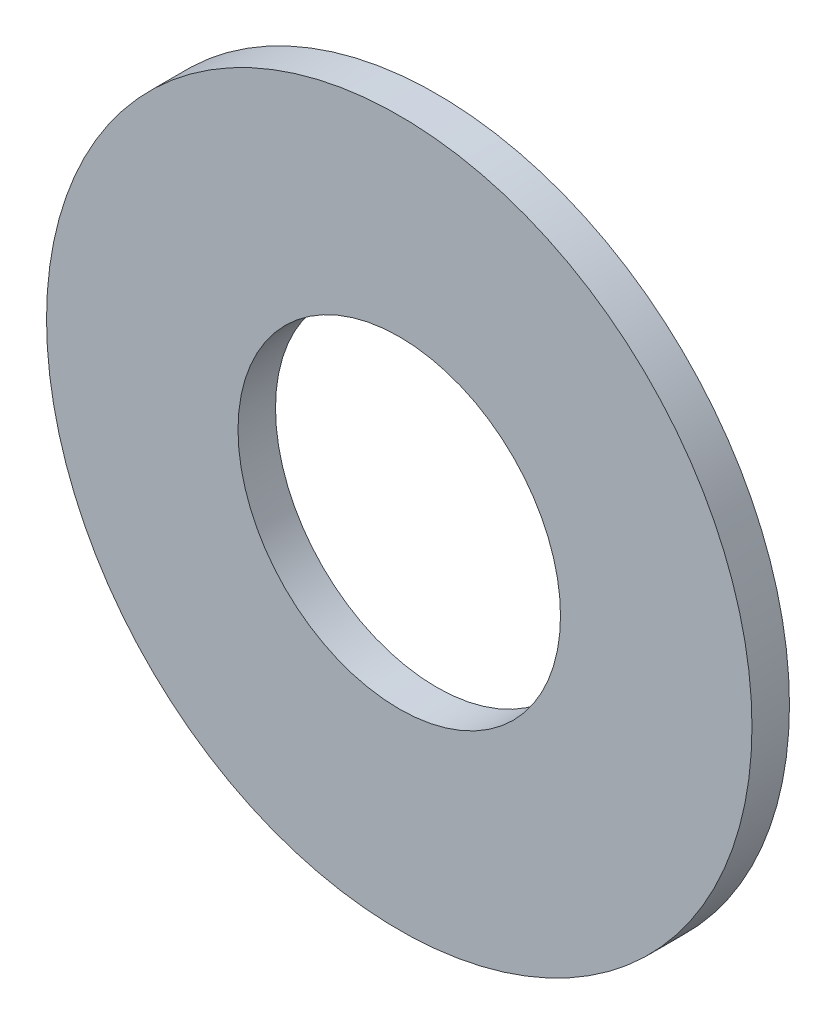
ISO-10303-21;
HEADER;
FILE_DESCRIPTION(('STEP AP214'),'2;1');
FILE_NAME('part.step','',(''),(''),'','','');
FILE_SCHEMA(('AUTOMOTIVE_DESIGN { 1 0 10303 214 1 1 1 1 }'));
ENDSEC;
DATA;
#1=APPLICATION_CONTEXT('core data for automotive mechanical design processes');
#2=APPLICATION_PROTOCOL_DEFINITION('international standard','automotive_design',2000,#1);
#3=PRODUCT_CONTEXT('',#1,'mechanical');
#4=PRODUCT('Part','Part','',(#3));
#5=PRODUCT_RELATED_PRODUCT_CATEGORY('part','',(#4));
#6=PRODUCT_DEFINITION_FORMATION('','',#4);
#7=PRODUCT_DEFINITION_CONTEXT('part definition',#1,'design');
#8=PRODUCT_DEFINITION('design','',#6,#7);
#9=PRODUCT_DEFINITION_SHAPE('','',#8);
#10=(LENGTH_UNIT() NAMED_UNIT(*) SI_UNIT(.MILLI.,.METRE.));
#11=(NAMED_UNIT(*) PLANE_ANGLE_UNIT() SI_UNIT($,.RADIAN.));
#12=(NAMED_UNIT(*) SI_UNIT($,.STERADIAN.) SOLID_ANGLE_UNIT());
#13=UNCERTAINTY_MEASURE_WITH_UNIT(LENGTH_MEASURE(1.E-05),#10,'distance_accuracy_value','');
#14=(GEOMETRIC_REPRESENTATION_CONTEXT(3) GLOBAL_UNCERTAINTY_ASSIGNED_CONTEXT((#13)) GLOBAL_UNIT_ASSIGNED_CONTEXT((#10,
#11,#12)) REPRESENTATION_CONTEXT('',''));
#15=CARTESIAN_POINT('',(0.,0.,0.));
#16=DIRECTION('',(0.,0.,1.));
#17=DIRECTION('',(1.,0.,0.));
#18=AXIS2_PLACEMENT_3D('',#15,#16,#17);
#19=CARTESIAN_POINT('',(0.,0.,-1.18109999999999));
#20=DIRECTION('',(0.,0.,1.));
#21=DIRECTION('',(1.00000000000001,0.,0.));
#22=AXIS2_PLACEMENT_3D('',#19,#20,#21);
#23=CYLINDRICAL_SURFACE('',#22,11.1125);
#24=CARTESIAN_POINT('',(0.,0.,-1.18109999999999));
#25=DIRECTION('',(0.,0.,1.));
#26=DIRECTION('',(1.00000000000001,0.,0.));
#27=AXIS2_PLACEMENT_3D('',#24,#25,#26);
#28=CIRCLE('',#27,11.1125);
#29=CARTESIAN_POINT('',(11.1125000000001,0.,-1.18109999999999));
#30=VERTEX_POINT('',#29);
#31=EDGE_CURVE('E10',#30,#30,#28,.T.);
#32=ORIENTED_EDGE('',*,*,#31,.T.);
#33=EDGE_LOOP('',(#32));
#34=FACE_BOUND('',#33,.T.);
#35=CARTESIAN_POINT('',(0.,0.,0.));
#36=DIRECTION('',(0.,0.,1.));
#37=DIRECTION('',(1.00000000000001,0.,0.));
#38=AXIS2_PLACEMENT_3D('',#35,#36,#37);
#39=CIRCLE('',#38,11.1125);
#40=CARTESIAN_POINT('',(11.1125000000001,0.,0.));
#41=VERTEX_POINT('',#40);
#42=EDGE_CURVE('E32',#41,#41,#39,.T.);
#43=ORIENTED_EDGE('',*,*,#42,.F.);
#44=EDGE_LOOP('',(#43));
#45=FACE_BOUND('',#44,.T.);
#46=ADVANCED_FACE('F26',(#34,#45),#23,.T.);
#47=CARTESIAN_POINT('',(0.,0.,-1.18109999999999));
#48=DIRECTION('',(0.,0.,1.));
#49=DIRECTION('',(1.00000000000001,0.,0.));
#50=AXIS2_PLACEMENT_3D('',#47,#48,#49);
#51=PLANE('',#50);
#52=CARTESIAN_POINT('',(0.,0.,-1.18109999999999));
#53=DIRECTION('',(0.,0.,1.));
#54=DIRECTION('',(1.00000000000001,0.,0.));
#55=AXIS2_PLACEMENT_3D('',#52,#53,#54);
#56=CIRCLE('',#55,5.08);
#57=CARTESIAN_POINT('',(5.08000000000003,0.,-1.18109999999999));
#58=VERTEX_POINT('',#57);
#59=EDGE_CURVE('E36',#58,#58,#56,.T.);
#60=ORIENTED_EDGE('',*,*,#59,.T.);
#61=EDGE_LOOP('',(#60));
#62=FACE_BOUND('',#61,.T.);
#63=ORIENTED_EDGE('',*,*,#31,.F.);
#64=EDGE_LOOP('',(#63));
#65=FACE_BOUND('',#64,.T.);
#66=ADVANCED_FACE('F50',(#62,#65),#51,.F.);
#67=CARTESIAN_POINT('',(0.,0.,0.));
#68=DIRECTION('',(0.,0.,1.));
#69=DIRECTION('',(1.00000000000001,0.,0.));
#70=AXIS2_PLACEMENT_3D('',#67,#68,#69);
#71=PLANE('',#70);
#72=CARTESIAN_POINT('',(0.,0.,0.));
#73=DIRECTION('',(0.,0.,1.));
#74=DIRECTION('',(1.00000000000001,0.,0.));
#75=AXIS2_PLACEMENT_3D('',#72,#73,#74);
#76=CIRCLE('',#75,5.08);
#77=CARTESIAN_POINT('',(5.08000000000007,0.,0.));
#78=VERTEX_POINT('',#77);
#79=EDGE_CURVE('E40',#78,#78,#76,.T.);
#80=ORIENTED_EDGE('',*,*,#79,.F.);
#81=EDGE_LOOP('',(#80));
#82=FACE_BOUND('',#81,.T.);
#83=ORIENTED_EDGE('',*,*,#42,.T.);
#84=EDGE_LOOP('',(#83));
#85=FACE_BOUND('',#84,.T.);
#86=ADVANCED_FACE('F48',(#82,#85),#71,.T.);
#87=CARTESIAN_POINT('',(0.,0.,-1.18109999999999));
#88=DIRECTION('',(0.,0.,1.));
#89=DIRECTION('',(1.00000000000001,0.,0.));
#90=AXIS2_PLACEMENT_3D('',#87,#88,#89);
#91=CYLINDRICAL_SURFACE('',#90,5.08);
#92=ORIENTED_EDGE('',*,*,#59,.F.);
#93=EDGE_LOOP('',(#92));
#94=FACE_BOUND('',#93,.T.);
#95=ORIENTED_EDGE('',*,*,#79,.T.);
#96=EDGE_LOOP('',(#95));
#97=FACE_BOUND('',#96,.T.);
#98=ADVANCED_FACE('F46',(#94,#97),#91,.F.);
#99=CLOSED_SHELL('',(#46,#66,#86,#98));
#100=MANIFOLD_SOLID_BREP('B2',#99);
#101=ADVANCED_BREP_SHAPE_REPRESENTATION('',(#18,#100),#14);
#102=SHAPE_DEFINITION_REPRESENTATION(#9,#101);
ENDSEC;
END-ISO-10303-21;
